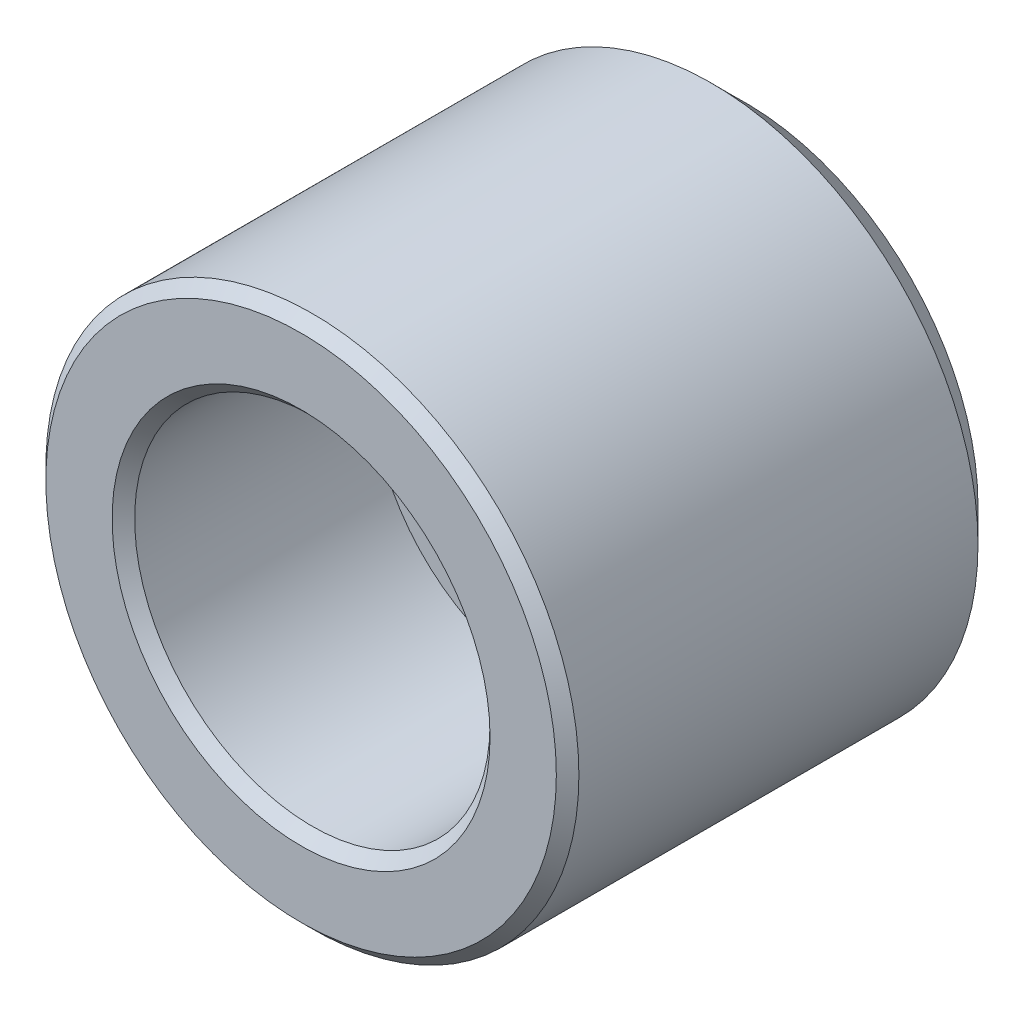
ISO-10303-21;
HEADER;
FILE_DESCRIPTION(('STEP AP214'),'2;1');
FILE_NAME('part.step','',(''),(''),'','','');
FILE_SCHEMA(('AUTOMOTIVE_DESIGN { 1 0 10303 214 1 1 1 1 }'));
ENDSEC;
DATA;
#1=APPLICATION_CONTEXT('core data for automotive mechanical design processes');
#2=APPLICATION_PROTOCOL_DEFINITION('international standard','automotive_design',2000,#1);
#3=PRODUCT_CONTEXT('',#1,'mechanical');
#4=PRODUCT('Part','Part','',(#3));
#5=PRODUCT_RELATED_PRODUCT_CATEGORY('part','',(#4));
#6=PRODUCT_DEFINITION_FORMATION('','',#4);
#7=PRODUCT_DEFINITION_CONTEXT('part definition',#1,'design');
#8=PRODUCT_DEFINITION('design','',#6,#7);
#9=PRODUCT_DEFINITION_SHAPE('','',#8);
#10=(LENGTH_UNIT() NAMED_UNIT(*) SI_UNIT(.MILLI.,.METRE.));
#11=(NAMED_UNIT(*) PLANE_ANGLE_UNIT() SI_UNIT($,.RADIAN.));
#12=(NAMED_UNIT(*) SI_UNIT($,.STERADIAN.) SOLID_ANGLE_UNIT());
#13=UNCERTAINTY_MEASURE_WITH_UNIT(LENGTH_MEASURE(1.E-05),#10,'distance_accuracy_value','');
#14=(GEOMETRIC_REPRESENTATION_CONTEXT(3) GLOBAL_UNCERTAINTY_ASSIGNED_CONTEXT((#13)) GLOBAL_UNIT_ASSIGNED_CONTEXT((#10,
#11,#12)) REPRESENTATION_CONTEXT('',''));
#15=CARTESIAN_POINT('',(0.,0.,0.));
#16=DIRECTION('',(0.,0.,1.));
#17=DIRECTION('',(1.,0.,0.));
#18=AXIS2_PLACEMENT_3D('',#15,#16,#17);
#19=CARTESIAN_POINT('',(0.,0.,10.));
#20=DIRECTION('',(0.,0.,1.));
#21=DIRECTION('',(1.,0.,0.));
#22=AXIS2_PLACEMENT_3D('',#19,#20,#21);
#23=CYLINDRICAL_SURFACE('',#22,2.25);
#24=CARTESIAN_POINT('',(0.,0.,0.2519));
#25=DIRECTION('',(0.,0.,1.));
#26=DIRECTION('',(1.,0.,0.));
#27=AXIS2_PLACEMENT_3D('',#24,#25,#26);
#28=CIRCLE('',#27,2.25);
#29=CARTESIAN_POINT('',(2.25,0.,0.2519));
#30=VERTEX_POINT('',#29);
#31=EDGE_CURVE('E32',#30,#30,#28,.T.);
#32=ORIENTED_EDGE('',*,*,#31,.F.);
#33=EDGE_LOOP('',(#32));
#34=FACE_BOUND('',#33,.T.);
#35=CARTESIAN_POINT('',(0.,0.,4.412));
#36=DIRECTION('',(0.,0.,1.));
#37=DIRECTION('',(1.,0.,0.));
#38=AXIS2_PLACEMENT_3D('',#35,#36,#37);
#39=CIRCLE('',#38,2.25);
#40=CARTESIAN_POINT('',(2.25,0.,4.412));
#41=VERTEX_POINT('',#40);
#42=EDGE_CURVE('E30',#41,#41,#39,.F.);
#43=ORIENTED_EDGE('',*,*,#42,.F.);
#44=EDGE_LOOP('',(#43));
#45=FACE_BOUND('',#44,.T.);
#46=ADVANCED_FACE('F12',(#34,#45),#23,.F.);
#47=CARTESIAN_POINT('',(0.,0.,0.));
#48=DIRECTION('',(0.,0.,1.));
#49=DIRECTION('',(1.,0.,0.));
#50=AXIS2_PLACEMENT_3D('',#47,#48,#49);
#51=CYLINDRICAL_SURFACE('',#50,6.);
#52=CARTESIAN_POINT('',(0.,0.,0.762));
#53=DIRECTION('',(0.,0.,1.));
#54=DIRECTION('',(1.,0.,0.));
#55=AXIS2_PLACEMENT_3D('',#52,#53,#54);
#56=CIRCLE('',#55,6.);
#57=CARTESIAN_POINT('',(6.,0.,0.762));
#58=VERTEX_POINT('',#57);
#59=EDGE_CURVE('E27',#58,#58,#56,.T.);
#60=ORIENTED_EDGE('',*,*,#59,.T.);
#61=EDGE_LOOP('',(#60));
#62=FACE_BOUND('',#61,.T.);
#63=CARTESIAN_POINT('',(0.,0.,9.746));
#64=DIRECTION('',(0.,0.,1.));
#65=DIRECTION('',(1.,0.,0.));
#66=AXIS2_PLACEMENT_3D('',#63,#64,#65);
#67=CIRCLE('',#66,6.);
#68=CARTESIAN_POINT('',(6.,0.,9.746));
#69=VERTEX_POINT('',#68);
#70=EDGE_CURVE('E37',#69,#69,#67,.F.);
#71=ORIENTED_EDGE('',*,*,#70,.T.);
#72=EDGE_LOOP('',(#71));
#73=FACE_BOUND('',#72,.T.);
#74=ADVANCED_FACE('F68',(#62,#73),#51,.T.);
#75=CARTESIAN_POINT('',(0.,0.,0.));
#76=DIRECTION('',(0.,0.,1.));
#77=DIRECTION('',(1.,0.,0.));
#78=AXIS2_PLACEMENT_3D('',#75,#76,#77);
#79=PLANE('',#78);
#80=CARTESIAN_POINT('',(0.,0.,0.));
#81=DIRECTION('',(0.,0.,1.));
#82=DIRECTION('',(1.,0.,0.));
#83=AXIS2_PLACEMENT_3D('',#80,#81,#82);
#84=CIRCLE('',#83,2.5019);
#85=CARTESIAN_POINT('',(2.5019,0.,0.));
#86=VERTEX_POINT('',#85);
#87=EDGE_CURVE('E43',#86,#86,#84,.T.);
#88=ORIENTED_EDGE('',*,*,#87,.T.);
#89=EDGE_LOOP('',(#88));
#90=FACE_BOUND('',#89,.T.);
#91=CARTESIAN_POINT('',(0.,0.,0.));
#92=DIRECTION('',(0.,0.,1.));
#93=DIRECTION('',(1.,0.,0.));
#94=AXIS2_PLACEMENT_3D('',#91,#92,#93);
#95=CIRCLE('',#94,5.238);
#96=CARTESIAN_POINT('',(5.238,0.,0.));
#97=VERTEX_POINT('',#96);
#98=EDGE_CURVE('E23',#97,#97,#95,.F.);
#99=ORIENTED_EDGE('',*,*,#98,.T.);
#100=EDGE_LOOP('',(#99));
#101=FACE_BOUND('',#100,.T.);
#102=ADVANCED_FACE('F74',(#90,#101),#79,.F.);
#103=CARTESIAN_POINT('',(0.,0.,10.));
#104=DIRECTION('',(0.,0.,1.));
#105=DIRECTION('',(1.,0.,0.));
#106=AXIS2_PLACEMENT_3D('',#103,#104,#105);
#107=PLANE('',#106);
#108=CARTESIAN_POINT('',(0.,0.,10.));
#109=DIRECTION('',(0.,0.,1.));
#110=DIRECTION('',(1.,0.,0.));
#111=AXIS2_PLACEMENT_3D('',#108,#109,#110);
#112=CIRCLE('',#111,4.254);
#113=CARTESIAN_POINT('',(4.254,0.,10.));
#114=VERTEX_POINT('',#113);
#115=EDGE_CURVE('E8',#114,#114,#112,.F.);
#116=ORIENTED_EDGE('',*,*,#115,.T.);
#117=EDGE_LOOP('',(#116));
#118=FACE_BOUND('',#117,.T.);
#119=CARTESIAN_POINT('',(0.,0.,10.));
#120=DIRECTION('',(0.,0.,1.));
#121=DIRECTION('',(1.,0.,0.));
#122=AXIS2_PLACEMENT_3D('',#119,#120,#121);
#123=CIRCLE('',#122,5.746);
#124=CARTESIAN_POINT('',(5.746,0.,10.));
#125=VERTEX_POINT('',#124);
#126=EDGE_CURVE('E40',#125,#125,#123,.T.);
#127=ORIENTED_EDGE('',*,*,#126,.T.);
#128=EDGE_LOOP('',(#127));
#129=FACE_BOUND('',#128,.T.);
#130=ADVANCED_FACE('F86',(#118,#129),#107,.T.);
#131=CARTESIAN_POINT('',(0.,0.,10.));
#132=DIRECTION('',(0.,0.,-1.));
#133=DIRECTION('',(-1.,0.,0.));
#134=AXIS2_PLACEMENT_3D('',#131,#132,#133);
#135=CONICAL_SURFACE('',#134,5.746,0.78539816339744);
#136=ORIENTED_EDGE('',*,*,#70,.F.);
#137=EDGE_LOOP('',(#136));
#138=FACE_BOUND('',#137,.T.);
#139=ORIENTED_EDGE('',*,*,#126,.F.);
#140=EDGE_LOOP('',(#139));
#141=FACE_BOUND('',#140,.T.);
#142=ADVANCED_FACE('F89',(#138,#141),#135,.T.);
#143=CARTESIAN_POINT('',(0.,0.,0.762));
#144=DIRECTION('',(0.,0.,1.));
#145=DIRECTION('',(1.,0.,0.));
#146=AXIS2_PLACEMENT_3D('',#143,#144,#145);
#147=CONICAL_SURFACE('',#146,6.,0.785398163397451);
#148=ORIENTED_EDGE('',*,*,#98,.F.);
#149=EDGE_LOOP('',(#148));
#150=FACE_BOUND('',#149,.T.);
#151=ORIENTED_EDGE('',*,*,#59,.F.);
#152=EDGE_LOOP('',(#151));
#153=FACE_BOUND('',#152,.T.);
#154=ADVANCED_FACE('F82',(#150,#153),#147,.T.);
#155=CARTESIAN_POINT('',(0.,0.,0.2519));
#156=DIRECTION('',(0.,0.,-1.));
#157=DIRECTION('',(-1.,0.,0.));
#158=AXIS2_PLACEMENT_3D('',#155,#156,#157);
#159=CONICAL_SURFACE('',#158,2.25,0.785398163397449);
#160=ORIENTED_EDGE('',*,*,#87,.F.);
#161=EDGE_LOOP('',(#160));
#162=FACE_BOUND('',#161,.T.);
#163=ORIENTED_EDGE('',*,*,#31,.T.);
#164=EDGE_LOOP('',(#163));
#165=FACE_BOUND('',#164,.T.);
#166=ADVANCED_FACE('F64',(#162,#165),#159,.F.);
#167=CARTESIAN_POINT('',(0.,0.,4.412));
#168=DIRECTION('',(0.,0.,1.));
#169=DIRECTION('',(1.,0.,0.));
#170=AXIS2_PLACEMENT_3D('',#167,#168,#169);
#171=PLANE('',#170);
#172=CARTESIAN_POINT('',(0.,0.,4.412));
#173=DIRECTION('',(0.,0.,1.));
#174=DIRECTION('',(1.,0.,0.));
#175=AXIS2_PLACEMENT_3D('',#172,#173,#174);
#176=CIRCLE('',#175,4.);
#177=CARTESIAN_POINT('',(4.,0.,4.412));
#178=VERTEX_POINT('',#177);
#179=EDGE_CURVE('E33',#178,#178,#176,.T.);
#180=ORIENTED_EDGE('',*,*,#179,.T.);
#181=EDGE_LOOP('',(#180));
#182=FACE_BOUND('',#181,.T.);
#183=ORIENTED_EDGE('',*,*,#42,.T.);
#184=EDGE_LOOP('',(#183));
#185=FACE_BOUND('',#184,.T.);
#186=ADVANCED_FACE('F51',(#182,#185),#171,.T.);
#187=CARTESIAN_POINT('',(0.,0.,4.412));
#188=DIRECTION('',(0.,0.,1.));
#189=DIRECTION('',(1.,0.,0.));
#190=AXIS2_PLACEMENT_3D('',#187,#188,#189);
#191=CYLINDRICAL_SURFACE('',#190,4.);
#192=CARTESIAN_POINT('',(0.,0.,9.746));
#193=DIRECTION('',(0.,0.,1.));
#194=DIRECTION('',(1.,0.,0.));
#195=AXIS2_PLACEMENT_3D('',#192,#193,#194);
#196=CIRCLE('',#195,4.);
#197=CARTESIAN_POINT('',(4.,0.,9.746));
#198=VERTEX_POINT('',#197);
#199=EDGE_CURVE('E19',#198,#198,#196,.T.);
#200=ORIENTED_EDGE('',*,*,#199,.T.);
#201=EDGE_LOOP('',(#200));
#202=FACE_BOUND('',#201,.T.);
#203=ORIENTED_EDGE('',*,*,#179,.F.);
#204=EDGE_LOOP('',(#203));
#205=FACE_BOUND('',#204,.T.);
#206=ADVANCED_FACE('F54',(#202,#205),#191,.F.);
#207=CARTESIAN_POINT('',(0.,0.,9.746));
#208=DIRECTION('',(0.,0.,1.));
#209=DIRECTION('',(1.,0.,0.));
#210=AXIS2_PLACEMENT_3D('',#207,#208,#209);
#211=CONICAL_SURFACE('',#210,4.,0.785398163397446);
#212=ORIENTED_EDGE('',*,*,#115,.F.);
#213=EDGE_LOOP('',(#212));
#214=FACE_BOUND('',#213,.T.);
#215=ORIENTED_EDGE('',*,*,#199,.F.);
#216=EDGE_LOOP('',(#215));
#217=FACE_BOUND('',#216,.T.);
#218=ADVANCED_FACE('F14',(#214,#217),#211,.F.);
#219=CLOSED_SHELL('',(#46,#74,#102,#130,#142,#154,#166,#186,#206,#218));
#220=MANIFOLD_SOLID_BREP('B1',#219);
#221=ADVANCED_BREP_SHAPE_REPRESENTATION('',(#18,#220),#14);
#222=SHAPE_DEFINITION_REPRESENTATION(#9,#221);
ENDSEC;
END-ISO-10303-21;
